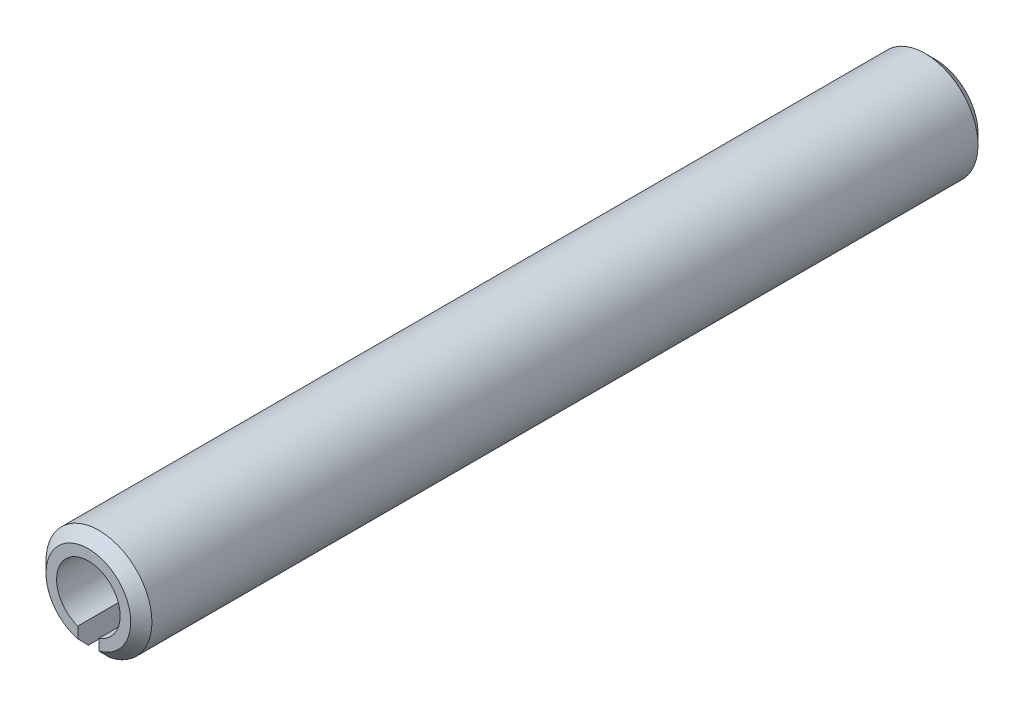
from build123d import *

# Parameters (mm, degrees)
EXTRUSION1_DEPTH = 40
CHANFREIN1_SIZE  = 0.5


with BuildPart() as part:
    # Esquisse1 → Extrusion1 (new body)
    with BuildSketch(Plane.XY):
        with BuildLine():
            Line((-0.5, -1.414213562), (-0.5, -2.449489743))
            ThreePointArc((-0.5, -2.449489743), (0, 2.5), (0.5, -2.449489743))
            Line((0.5, -2.449489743), (0.5, -1.414213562))
            ThreePointArc((0.5, -1.414213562), (0, 1.5), (-0.5, -1.414213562))
        make_face()
    extrude(amount=EXTRUSION1_DEPTH)

    # Chanfrein1
    chanfrein1_edges = [part.edges().sort_by_distance(p)[0] for p in [
        (0, 2.5, 40),
        (0, 2.5, 0),
    ]]
    chamfer(chanfrein1_edges, length=CHANFREIN1_SIZE)


solid = part.part
